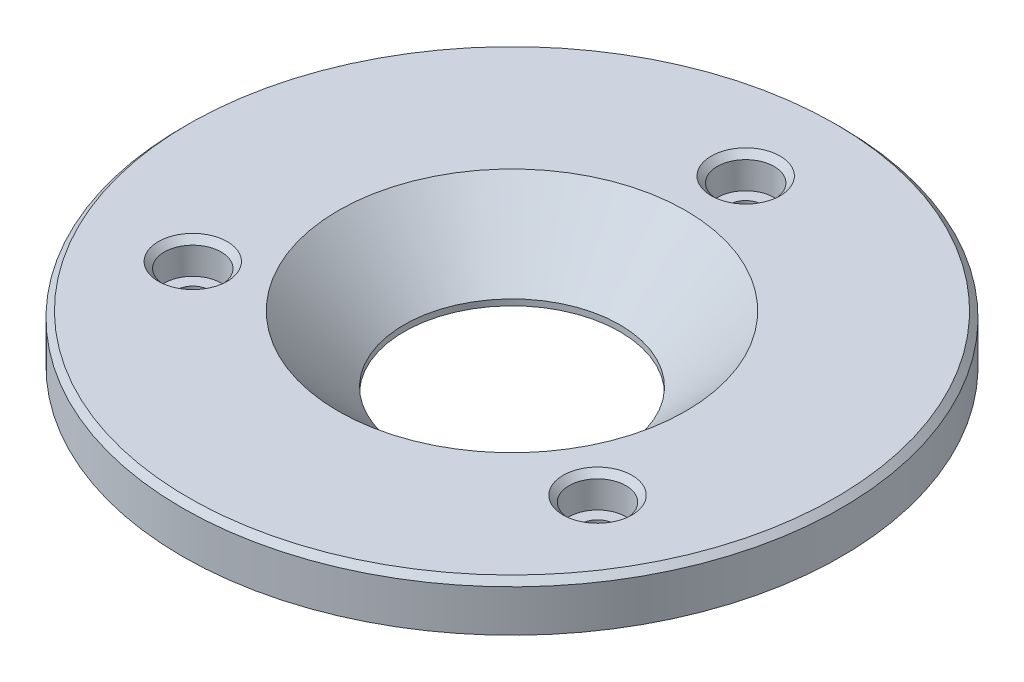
ISO-10303-21;
HEADER;
FILE_DESCRIPTION(('STEP AP214'),'2;1');
FILE_NAME('part.step','',(''),(''),'','','');
FILE_SCHEMA(('AUTOMOTIVE_DESIGN { 1 0 10303 214 1 1 1 1 }'));
ENDSEC;
DATA;
#1=APPLICATION_CONTEXT('core data for automotive mechanical design processes');
#2=APPLICATION_PROTOCOL_DEFINITION('international standard','automotive_design',2000,#1);
#3=PRODUCT_CONTEXT('',#1,'mechanical');
#4=PRODUCT('Part','Part','',(#3));
#5=PRODUCT_RELATED_PRODUCT_CATEGORY('part','',(#4));
#6=PRODUCT_DEFINITION_FORMATION('','',#4);
#7=PRODUCT_DEFINITION_CONTEXT('part definition',#1,'design');
#8=PRODUCT_DEFINITION('design','',#6,#7);
#9=PRODUCT_DEFINITION_SHAPE('','',#8);
#10=(LENGTH_UNIT() NAMED_UNIT(*) SI_UNIT(.MILLI.,.METRE.));
#11=(NAMED_UNIT(*) PLANE_ANGLE_UNIT() SI_UNIT($,.RADIAN.));
#12=(NAMED_UNIT(*) SI_UNIT($,.STERADIAN.) SOLID_ANGLE_UNIT());
#13=UNCERTAINTY_MEASURE_WITH_UNIT(LENGTH_MEASURE(1.E-05),#10,'distance_accuracy_value','');
#14=(GEOMETRIC_REPRESENTATION_CONTEXT(3) GLOBAL_UNCERTAINTY_ASSIGNED_CONTEXT((#13)) GLOBAL_UNIT_ASSIGNED_CONTEXT((#10,
#11,#12)) REPRESENTATION_CONTEXT('',''));
#15=CARTESIAN_POINT('',(0.,0.,0.));
#16=DIRECTION('',(0.,0.,1.));
#17=DIRECTION('',(1.,0.,0.));
#18=AXIS2_PLACEMENT_3D('',#15,#16,#17);
#19=CARTESIAN_POINT('',(-29.,12.,0.));
#20=DIRECTION('',(0.,-1.,0.));
#21=DIRECTION('',(0.,0.,-1.));
#22=AXIS2_PLACEMENT_3D('',#19,#20,#21);
#23=PLANE('',#22);
#24=CARTESIAN_POINT('',(33.7749907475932,12.,19.5));
#25=DIRECTION('',(0.,-1.,0.));
#26=DIRECTION('',(0.,0.,-1.));
#27=AXIS2_PLACEMENT_3D('',#24,#25,#26);
#28=CIRCLE('',#27,5.75);
#29=CARTESIAN_POINT('',(33.7749907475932,12.,13.75));
#30=VERTEX_POINT('',#29);
#31=EDGE_CURVE('E25',#30,#30,#28,.T.);
#32=ORIENTED_EDGE('',*,*,#31,.T.);
#33=EDGE_LOOP('',(#32));
#34=FACE_BOUND('',#33,.T.);
#35=CARTESIAN_POINT('',(0.,12.,-39.));
#36=DIRECTION('',(0.,-1.,0.));
#37=DIRECTION('',(0.,0.,-1.));
#38=AXIS2_PLACEMENT_3D('',#35,#36,#37);
#39=CIRCLE('',#38,5.75);
#40=CARTESIAN_POINT('',(0.,12.,-44.75));
#41=VERTEX_POINT('',#40);
#42=EDGE_CURVE('E29',#41,#41,#39,.T.);
#43=ORIENTED_EDGE('',*,*,#42,.T.);
#44=EDGE_LOOP('',(#43));
#45=FACE_BOUND('',#44,.T.);
#46=CARTESIAN_POINT('',(-33.7749907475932,12.,19.5));
#47=DIRECTION('',(0.,-1.,0.));
#48=DIRECTION('',(0.,0.,-1.));
#49=AXIS2_PLACEMENT_3D('',#46,#47,#48);
#50=CIRCLE('',#49,5.75);
#51=CARTESIAN_POINT('',(-33.7749907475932,12.,13.75));
#52=VERTEX_POINT('',#51);
#53=EDGE_CURVE('E34',#52,#52,#50,.T.);
#54=ORIENTED_EDGE('',*,*,#53,.T.);
#55=EDGE_LOOP('',(#54));
#56=FACE_BOUND('',#55,.T.);
#57=CARTESIAN_POINT('',(0.,12.,0.));
#58=DIRECTION('',(0.,-1.,0.));
#59=DIRECTION('',(0.,0.,-1.));
#60=AXIS2_PLACEMENT_3D('',#57,#58,#59);
#61=CIRCLE('',#60,54.);
#62=CARTESIAN_POINT('',(0.,12.,-54.));
#63=VERTEX_POINT('',#62);
#64=EDGE_CURVE('E58',#63,#63,#61,.F.);
#65=ORIENTED_EDGE('',*,*,#64,.T.);
#66=EDGE_LOOP('',(#65));
#67=FACE_BOUND('',#66,.T.);
#68=CARTESIAN_POINT('',(0.,12.,0.));
#69=DIRECTION('',(0.,-1.,0.));
#70=DIRECTION('',(0.,0.,-1.));
#71=AXIS2_PLACEMENT_3D('',#68,#69,#70);
#72=CIRCLE('',#71,29.);
#73=CARTESIAN_POINT('',(0.,12.,-29.));
#74=VERTEX_POINT('',#73);
#75=EDGE_CURVE('E70',#74,#74,#72,.T.);
#76=ORIENTED_EDGE('',*,*,#75,.T.);
#77=EDGE_LOOP('',(#76));
#78=FACE_BOUND('',#77,.T.);
#79=ADVANCED_FACE('F14',(#34,#45,#56,#67,#78),#23,.F.);
#80=CARTESIAN_POINT('',(0.,1.,0.));
#81=DIRECTION('',(0.,1.,0.));
#82=DIRECTION('',(0.,0.,1.));
#83=AXIS2_PLACEMENT_3D('',#80,#81,#82);
#84=CONICAL_SURFACE('',#83,18.,0.78539816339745);
#85=ORIENTED_EDGE('',*,*,#75,.F.);
#86=EDGE_LOOP('',(#85));
#87=FACE_BOUND('',#86,.T.);
#88=CARTESIAN_POINT('',(0.,1.,0.));
#89=DIRECTION('',(0.,-1.,0.));
#90=DIRECTION('',(0.,0.,-1.));
#91=AXIS2_PLACEMENT_3D('',#88,#89,#90);
#92=CIRCLE('',#91,18.);
#93=CARTESIAN_POINT('',(0.,1.,-18.));
#94=VERTEX_POINT('',#93);
#95=EDGE_CURVE('E83',#94,#94,#92,.T.);
#96=ORIENTED_EDGE('',*,*,#95,.T.);
#97=EDGE_LOOP('',(#96));
#98=FACE_BOUND('',#97,.T.);
#99=ADVANCED_FACE('F123',(#87,#98),#84,.F.);
#100=CARTESIAN_POINT('',(0.,0.,0.));
#101=DIRECTION('',(0.,-1.,0.));
#102=DIRECTION('',(0.,0.,-1.));
#103=AXIS2_PLACEMENT_3D('',#100,#101,#102);
#104=CYLINDRICAL_SURFACE('',#103,18.);
#105=ORIENTED_EDGE('',*,*,#95,.F.);
#106=EDGE_LOOP('',(#105));
#107=FACE_BOUND('',#106,.T.);
#108=CARTESIAN_POINT('',(0.,0.,0.));
#109=DIRECTION('',(0.,-1.,0.));
#110=DIRECTION('',(0.,0.,-1.));
#111=AXIS2_PLACEMENT_3D('',#108,#109,#110);
#112=CIRCLE('',#111,18.);
#113=CARTESIAN_POINT('',(0.,0.,-18.));
#114=VERTEX_POINT('',#113);
#115=EDGE_CURVE('E86',#114,#114,#112,.T.);
#116=ORIENTED_EDGE('',*,*,#115,.T.);
#117=EDGE_LOOP('',(#116));
#118=FACE_BOUND('',#117,.T.);
#119=ADVANCED_FACE('F130',(#107,#118),#104,.F.);
#120=CARTESIAN_POINT('',(-18.,0.,0.));
#121=DIRECTION('',(0.,1.,0.));
#122=DIRECTION('',(0.,0.,1.));
#123=AXIS2_PLACEMENT_3D('',#120,#121,#122);
#124=PLANE('',#123);
#125=CARTESIAN_POINT('',(-33.7749907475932,0.,19.5));
#126=DIRECTION('',(0.,1.,0.));
#127=DIRECTION('',(0.,0.,1.));
#128=AXIS2_PLACEMENT_3D('',#125,#126,#127);
#129=CIRCLE('',#128,3.75);
#130=CARTESIAN_POINT('',(-33.7749907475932,0.,23.25));
#131=VERTEX_POINT('',#130);
#132=EDGE_CURVE('E49',#131,#131,#129,.T.);
#133=ORIENTED_EDGE('',*,*,#132,.T.);
#134=EDGE_LOOP('',(#133));
#135=FACE_BOUND('',#134,.T.);
#136=CARTESIAN_POINT('',(33.7749907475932,0.,19.5));
#137=DIRECTION('',(0.,1.,0.));
#138=DIRECTION('',(0.,0.,1.));
#139=AXIS2_PLACEMENT_3D('',#136,#137,#138);
#140=CIRCLE('',#139,3.75);
#141=CARTESIAN_POINT('',(33.7749907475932,0.,23.25));
#142=VERTEX_POINT('',#141);
#143=EDGE_CURVE('E52',#142,#142,#140,.T.);
#144=ORIENTED_EDGE('',*,*,#143,.T.);
#145=EDGE_LOOP('',(#144));
#146=FACE_BOUND('',#145,.T.);
#147=CARTESIAN_POINT('',(0.,0.,-39.));
#148=DIRECTION('',(0.,1.,0.));
#149=DIRECTION('',(0.,0.,1.));
#150=AXIS2_PLACEMENT_3D('',#147,#148,#149);
#151=CIRCLE('',#150,3.75);
#152=CARTESIAN_POINT('',(0.,0.,-35.25));
#153=VERTEX_POINT('',#152);
#154=EDGE_CURVE('E55',#153,#153,#151,.T.);
#155=ORIENTED_EDGE('',*,*,#154,.T.);
#156=EDGE_LOOP('',(#155));
#157=FACE_BOUND('',#156,.T.);
#158=CARTESIAN_POINT('',(0.,0.,0.));
#159=DIRECTION('',(0.,1.,0.));
#160=DIRECTION('',(0.,0.,1.));
#161=AXIS2_PLACEMENT_3D('',#158,#159,#160);
#162=CIRCLE('',#161,44.);
#163=CARTESIAN_POINT('',(0.,0.,44.));
#164=VERTEX_POINT('',#163);
#165=EDGE_CURVE('E67',#164,#164,#162,.F.);
#166=ORIENTED_EDGE('',*,*,#165,.T.);
#167=EDGE_LOOP('',(#166));
#168=FACE_BOUND('',#167,.T.);
#169=ORIENTED_EDGE('',*,*,#115,.F.);
#170=EDGE_LOOP('',(#169));
#171=FACE_BOUND('',#170,.T.);
#172=ADVANCED_FACE('F181',(#135,#146,#157,#168,#171),#124,.F.);
#173=CARTESIAN_POINT('',(0.,0.,0.));
#174=DIRECTION('',(0.,-1.,0.));
#175=DIRECTION('',(0.,0.,-1.));
#176=AXIS2_PLACEMENT_3D('',#173,#174,#175);
#177=CYLINDRICAL_SURFACE('',#176,45.);
#178=CARTESIAN_POINT('',(0.,1.00000000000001,0.));
#179=DIRECTION('',(0.,1.,0.));
#180=DIRECTION('',(0.,0.,1.));
#181=AXIS2_PLACEMENT_3D('',#178,#179,#180);
#182=CIRCLE('',#181,45.);
#183=CARTESIAN_POINT('',(0.,1.00000000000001,45.));
#184=VERTEX_POINT('',#183);
#185=EDGE_CURVE('E64',#184,#184,#182,.T.);
#186=ORIENTED_EDGE('',*,*,#185,.T.);
#187=EDGE_LOOP('',(#186));
#188=FACE_BOUND('',#187,.T.);
#189=CARTESIAN_POINT('',(0.,4.,0.));
#190=DIRECTION('',(0.,-1.,0.));
#191=DIRECTION('',(0.,0.,-1.));
#192=AXIS2_PLACEMENT_3D('',#189,#190,#191);
#193=CIRCLE('',#192,45.);
#194=CARTESIAN_POINT('',(0.,4.,-45.));
#195=VERTEX_POINT('',#194);
#196=EDGE_CURVE('E89',#195,#195,#193,.T.);
#197=ORIENTED_EDGE('',*,*,#196,.T.);
#198=EDGE_LOOP('',(#197));
#199=FACE_BOUND('',#198,.T.);
#200=ADVANCED_FACE('F185',(#188,#199),#177,.T.);
#201=CARTESIAN_POINT('',(-45.,4.,0.));
#202=DIRECTION('',(0.,1.,0.));
#203=DIRECTION('',(0.,0.,1.));
#204=AXIS2_PLACEMENT_3D('',#201,#202,#203);
#205=PLANE('',#204);
#206=ORIENTED_EDGE('',*,*,#196,.F.);
#207=EDGE_LOOP('',(#206));
#208=FACE_BOUND('',#207,.T.);
#209=CARTESIAN_POINT('',(0.,4.,0.));
#210=DIRECTION('',(0.,-1.,0.));
#211=DIRECTION('',(0.,0.,-1.));
#212=AXIS2_PLACEMENT_3D('',#209,#210,#211);
#213=CIRCLE('',#212,55.);
#214=CARTESIAN_POINT('',(0.,4.,-55.));
#215=VERTEX_POINT('',#214);
#216=EDGE_CURVE('E92',#215,#215,#213,.T.);
#217=ORIENTED_EDGE('',*,*,#216,.T.);
#218=EDGE_LOOP('',(#217));
#219=FACE_BOUND('',#218,.T.);
#220=ADVANCED_FACE('F192',(#208,#219),#205,.F.);
#221=CARTESIAN_POINT('',(0.,0.,0.));
#222=DIRECTION('',(0.,-1.,0.));
#223=DIRECTION('',(0.,0.,-1.));
#224=AXIS2_PLACEMENT_3D('',#221,#222,#223);
#225=CYLINDRICAL_SURFACE('',#224,55.);
#226=CARTESIAN_POINT('',(0.,11.,0.));
#227=DIRECTION('',(0.,-1.,0.));
#228=DIRECTION('',(0.,0.,-1.));
#229=AXIS2_PLACEMENT_3D('',#226,#227,#228);
#230=CIRCLE('',#229,55.);
#231=CARTESIAN_POINT('',(0.,11.,-55.));
#232=VERTEX_POINT('',#231);
#233=EDGE_CURVE('E61',#232,#232,#230,.T.);
#234=ORIENTED_EDGE('',*,*,#233,.T.);
#235=EDGE_LOOP('',(#234));
#236=FACE_BOUND('',#235,.T.);
#237=ORIENTED_EDGE('',*,*,#216,.F.);
#238=EDGE_LOOP('',(#237));
#239=FACE_BOUND('',#238,.T.);
#240=ADVANCED_FACE('F199',(#236,#239),#225,.T.);
#241=CARTESIAN_POINT('',(33.7749907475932,6.5,19.5));
#242=DIRECTION('',(0.,1.,0.));
#243=DIRECTION('',(0.,0.,1.));
#244=AXIS2_PLACEMENT_3D('',#241,#242,#243);
#245=CYLINDRICAL_SURFACE('',#244,4.75);
#246=CARTESIAN_POINT('',(33.7749907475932,11.,19.5));
#247=DIRECTION('',(0.,-1.,0.));
#248=DIRECTION('',(0.,0.,-1.));
#249=AXIS2_PLACEMENT_3D('',#246,#247,#248);
#250=CIRCLE('',#249,4.75);
#251=CARTESIAN_POINT('',(33.7749907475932,11.,14.75));
#252=VERTEX_POINT('',#251);
#253=EDGE_CURVE('E37',#252,#252,#250,.F.);
#254=ORIENTED_EDGE('',*,*,#253,.T.);
#255=EDGE_LOOP('',(#254));
#256=FACE_BOUND('',#255,.T.);
#257=CARTESIAN_POINT('',(33.7749907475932,6.5,19.5));
#258=DIRECTION('',(0.,1.,0.));
#259=DIRECTION('',(0.,0.,-1.));
#260=AXIS2_PLACEMENT_3D('',#257,#258,#259);
#261=CIRCLE('',#260,4.75);
#262=CARTESIAN_POINT('',(33.7749907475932,6.5,14.75));
#263=VERTEX_POINT('',#262);
#264=EDGE_CURVE('E74',#263,#263,#261,.T.);
#265=ORIENTED_EDGE('',*,*,#264,.F.);
#266=EDGE_LOOP('',(#265));
#267=FACE_BOUND('',#266,.T.);
#268=ADVANCED_FACE('F203',(#256,#267),#245,.F.);
#269=CARTESIAN_POINT('',(33.7749907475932,6.5,19.5));
#270=DIRECTION('',(0.,-1.,0.));
#271=DIRECTION('',(0.,0.,-1.));
#272=AXIS2_PLACEMENT_3D('',#269,#270,#271);
#273=PLANE('',#272);
#274=CARTESIAN_POINT('',(33.7749907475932,6.5,19.5));
#275=DIRECTION('',(0.,-1.,0.));
#276=DIRECTION('',(0.,0.,-1.));
#277=AXIS2_PLACEMENT_3D('',#274,#275,#276);
#278=CIRCLE('',#277,2.75);
#279=CARTESIAN_POINT('',(33.7749907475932,6.5,16.75));
#280=VERTEX_POINT('',#279);
#281=EDGE_CURVE('E71',#280,#280,#278,.T.);
#282=ORIENTED_EDGE('',*,*,#281,.T.);
#283=EDGE_LOOP('',(#282));
#284=FACE_BOUND('',#283,.T.);
#285=ORIENTED_EDGE('',*,*,#264,.T.);
#286=EDGE_LOOP('',(#285));
#287=FACE_BOUND('',#286,.T.);
#288=ADVANCED_FACE('F207',(#284,#287),#273,.F.);
#289=CARTESIAN_POINT('',(-33.7749907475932,6.5,19.5));
#290=DIRECTION('',(0.,1.,0.));
#291=DIRECTION('',(0.,0.,1.));
#292=AXIS2_PLACEMENT_3D('',#289,#290,#291);
#293=CYLINDRICAL_SURFACE('',#292,4.75);
#294=CARTESIAN_POINT('',(-33.7749907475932,11.,19.5));
#295=DIRECTION('',(0.,-1.,0.));
#296=DIRECTION('',(0.,0.,-1.));
#297=AXIS2_PLACEMENT_3D('',#294,#295,#296);
#298=CIRCLE('',#297,4.75);
#299=CARTESIAN_POINT('',(-33.7749907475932,11.,14.75));
#300=VERTEX_POINT('',#299);
#301=EDGE_CURVE('E9',#300,#300,#298,.F.);
#302=ORIENTED_EDGE('',*,*,#301,.T.);
#303=EDGE_LOOP('',(#302));
#304=FACE_BOUND('',#303,.T.);
#305=CARTESIAN_POINT('',(-33.7749907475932,6.5,19.5));
#306=DIRECTION('',(0.,1.,0.));
#307=DIRECTION('',(0.,0.,1.));
#308=AXIS2_PLACEMENT_3D('',#305,#306,#307);
#309=CIRCLE('',#308,4.75);
#310=CARTESIAN_POINT('',(-33.7749907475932,6.5,24.25));
#311=VERTEX_POINT('',#310);
#312=EDGE_CURVE('E98',#311,#311,#309,.T.);
#313=ORIENTED_EDGE('',*,*,#312,.F.);
#314=EDGE_LOOP('',(#313));
#315=FACE_BOUND('',#314,.T.);
#316=ADVANCED_FACE('F119',(#304,#315),#293,.F.);
#317=CARTESIAN_POINT('',(-33.7749907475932,6.5,19.5));
#318=DIRECTION('',(0.,1.,0.));
#319=DIRECTION('',(0.,0.,1.));
#320=AXIS2_PLACEMENT_3D('',#317,#318,#319);
#321=PLANE('',#320);
#322=CARTESIAN_POINT('',(-33.7749907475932,6.5,19.5));
#323=DIRECTION('',(0.,1.,0.));
#324=DIRECTION('',(0.,0.,1.));
#325=AXIS2_PLACEMENT_3D('',#322,#323,#324);
#326=CIRCLE('',#325,2.75);
#327=CARTESIAN_POINT('',(-33.7749907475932,6.5,22.25));
#328=VERTEX_POINT('',#327);
#329=EDGE_CURVE('E75',#328,#328,#326,.T.);
#330=ORIENTED_EDGE('',*,*,#329,.F.);
#331=EDGE_LOOP('',(#330));
#332=FACE_BOUND('',#331,.T.);
#333=ORIENTED_EDGE('',*,*,#312,.T.);
#334=EDGE_LOOP('',(#333));
#335=FACE_BOUND('',#334,.T.);
#336=ADVANCED_FACE('F108',(#332,#335),#321,.T.);
#337=CARTESIAN_POINT('',(0.,6.5,-39.));
#338=DIRECTION('',(0.,1.,0.));
#339=DIRECTION('',(0.,0.,1.));
#340=AXIS2_PLACEMENT_3D('',#337,#338,#339);
#341=CYLINDRICAL_SURFACE('',#340,4.75);
#342=CARTESIAN_POINT('',(0.,11.,-39.));
#343=DIRECTION('',(0.,-1.,0.));
#344=DIRECTION('',(0.,0.,-1.));
#345=AXIS2_PLACEMENT_3D('',#342,#343,#344);
#346=CIRCLE('',#345,4.75);
#347=CARTESIAN_POINT('',(0.,11.,-43.75));
#348=VERTEX_POINT('',#347);
#349=EDGE_CURVE('E21',#348,#348,#346,.F.);
#350=ORIENTED_EDGE('',*,*,#349,.T.);
#351=EDGE_LOOP('',(#350));
#352=FACE_BOUND('',#351,.T.);
#353=CARTESIAN_POINT('',(0.,6.5,-39.));
#354=DIRECTION('',(0.,1.,0.));
#355=DIRECTION('',(0.,0.,1.));
#356=AXIS2_PLACEMENT_3D('',#353,#354,#355);
#357=CIRCLE('',#356,4.75);
#358=CARTESIAN_POINT('',(0.,6.5,-34.25));
#359=VERTEX_POINT('',#358);
#360=EDGE_CURVE('E95',#359,#359,#357,.T.);
#361=ORIENTED_EDGE('',*,*,#360,.F.);
#362=EDGE_LOOP('',(#361));
#363=FACE_BOUND('',#362,.T.);
#364=ADVANCED_FACE('F106',(#352,#363),#341,.F.);
#365=CARTESIAN_POINT('',(0.,6.5,-39.));
#366=DIRECTION('',(0.,1.,0.));
#367=DIRECTION('',(0.,0.,1.));
#368=AXIS2_PLACEMENT_3D('',#365,#366,#367);
#369=PLANE('',#368);
#370=CARTESIAN_POINT('',(0.,6.5,-39.));
#371=DIRECTION('',(0.,1.,0.));
#372=DIRECTION('',(0.,0.,1.));
#373=AXIS2_PLACEMENT_3D('',#370,#371,#372);
#374=CIRCLE('',#373,2.75);
#375=CARTESIAN_POINT('',(0.,6.5,-36.25));
#376=VERTEX_POINT('',#375);
#377=EDGE_CURVE('E78',#376,#376,#374,.T.);
#378=ORIENTED_EDGE('',*,*,#377,.F.);
#379=EDGE_LOOP('',(#378));
#380=FACE_BOUND('',#379,.T.);
#381=ORIENTED_EDGE('',*,*,#360,.T.);
#382=EDGE_LOOP('',(#381));
#383=FACE_BOUND('',#382,.T.);
#384=ADVANCED_FACE('F104',(#380,#383),#369,.T.);
#385=CARTESIAN_POINT('',(0.,0.,-39.));
#386=DIRECTION('',(0.,1.,0.));
#387=DIRECTION('',(0.,0.,1.));
#388=AXIS2_PLACEMENT_3D('',#385,#386,#387);
#389=CYLINDRICAL_SURFACE('',#388,2.75);
#390=CARTESIAN_POINT('',(0.,1.,-39.));
#391=DIRECTION('',(0.,1.,0.));
#392=DIRECTION('',(0.,0.,1.));
#393=AXIS2_PLACEMENT_3D('',#390,#391,#392);
#394=CIRCLE('',#393,2.75);
#395=CARTESIAN_POINT('',(0.,1.,-36.25));
#396=VERTEX_POINT('',#395);
#397=EDGE_CURVE('E40',#396,#396,#394,.F.);
#398=ORIENTED_EDGE('',*,*,#397,.T.);
#399=EDGE_LOOP('',(#398));
#400=FACE_BOUND('',#399,.T.);
#401=ORIENTED_EDGE('',*,*,#377,.T.);
#402=EDGE_LOOP('',(#401));
#403=FACE_BOUND('',#402,.T.);
#404=ADVANCED_FACE('F116',(#400,#403),#389,.F.);
#405=CARTESIAN_POINT('',(-33.7749907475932,0.,19.5));
#406=DIRECTION('',(0.,1.,0.));
#407=DIRECTION('',(0.,0.,1.));
#408=AXIS2_PLACEMENT_3D('',#405,#406,#407);
#409=CYLINDRICAL_SURFACE('',#408,2.75);
#410=CARTESIAN_POINT('',(-33.7749907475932,1.,19.5));
#411=DIRECTION('',(0.,1.,0.));
#412=DIRECTION('',(0.,0.,1.));
#413=AXIS2_PLACEMENT_3D('',#410,#411,#412);
#414=CIRCLE('',#413,2.75);
#415=CARTESIAN_POINT('',(-33.7749907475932,1.,22.25));
#416=VERTEX_POINT('',#415);
#417=EDGE_CURVE('E46',#416,#416,#414,.F.);
#418=ORIENTED_EDGE('',*,*,#417,.T.);
#419=EDGE_LOOP('',(#418));
#420=FACE_BOUND('',#419,.T.);
#421=ORIENTED_EDGE('',*,*,#329,.T.);
#422=EDGE_LOOP('',(#421));
#423=FACE_BOUND('',#422,.T.);
#424=ADVANCED_FACE('F338',(#420,#423),#409,.F.);
#425=CARTESIAN_POINT('',(33.7749907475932,0.,19.5));
#426=DIRECTION('',(0.,1.,0.));
#427=DIRECTION('',(0.,0.,1.));
#428=AXIS2_PLACEMENT_3D('',#425,#426,#427);
#429=CYLINDRICAL_SURFACE('',#428,2.75);
#430=CARTESIAN_POINT('',(33.7749907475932,1.,19.5));
#431=DIRECTION('',(0.,1.,0.));
#432=DIRECTION('',(0.,0.,1.));
#433=AXIS2_PLACEMENT_3D('',#430,#431,#432);
#434=CIRCLE('',#433,2.75);
#435=CARTESIAN_POINT('',(33.7749907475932,1.,22.25));
#436=VERTEX_POINT('',#435);
#437=EDGE_CURVE('E43',#436,#436,#434,.F.);
#438=ORIENTED_EDGE('',*,*,#437,.T.);
#439=EDGE_LOOP('',(#438));
#440=FACE_BOUND('',#439,.T.);
#441=ORIENTED_EDGE('',*,*,#281,.F.);
#442=EDGE_LOOP('',(#441));
#443=FACE_BOUND('',#442,.T.);
#444=ADVANCED_FACE('F140',(#440,#443),#429,.F.);
#445=CARTESIAN_POINT('',(0.,0.,0.));
#446=DIRECTION('',(0.,1.,0.));
#447=DIRECTION('',(0.,0.,1.));
#448=AXIS2_PLACEMENT_3D('',#445,#446,#447);
#449=CONICAL_SURFACE('',#448,44.,0.785398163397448);
#450=ORIENTED_EDGE('',*,*,#185,.F.);
#451=EDGE_LOOP('',(#450));
#452=FACE_BOUND('',#451,.T.);
#453=ORIENTED_EDGE('',*,*,#165,.F.);
#454=EDGE_LOOP('',(#453));
#455=FACE_BOUND('',#454,.T.);
#456=ADVANCED_FACE('F136',(#452,#455),#449,.T.);
#457=CARTESIAN_POINT('',(0.,11.,0.));
#458=DIRECTION('',(0.,-1.,0.));
#459=DIRECTION('',(0.,0.,-1.));
#460=AXIS2_PLACEMENT_3D('',#457,#458,#459);
#461=CONICAL_SURFACE('',#460,55.,0.785398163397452);
#462=ORIENTED_EDGE('',*,*,#64,.F.);
#463=EDGE_LOOP('',(#462));
#464=FACE_BOUND('',#463,.T.);
#465=ORIENTED_EDGE('',*,*,#233,.F.);
#466=EDGE_LOOP('',(#465));
#467=FACE_BOUND('',#466,.T.);
#468=ADVANCED_FACE('F139',(#464,#467),#461,.T.);
#469=CARTESIAN_POINT('',(-33.7749907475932,0.,19.5));
#470=DIRECTION('',(0.,-1.,0.));
#471=DIRECTION('',(0.,0.,-1.));
#472=AXIS2_PLACEMENT_3D('',#469,#470,#471);
#473=CONICAL_SURFACE('',#472,3.75,0.785398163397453);
#474=ORIENTED_EDGE('',*,*,#417,.F.);
#475=EDGE_LOOP('',(#474));
#476=FACE_BOUND('',#475,.T.);
#477=ORIENTED_EDGE('',*,*,#132,.F.);
#478=EDGE_LOOP('',(#477));
#479=FACE_BOUND('',#478,.T.);
#480=ADVANCED_FACE('F144',(#476,#479),#473,.F.);
#481=CARTESIAN_POINT('',(33.7749907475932,0.,19.5));
#482=DIRECTION('',(0.,-1.,0.));
#483=DIRECTION('',(0.,0.,-1.));
#484=AXIS2_PLACEMENT_3D('',#481,#482,#483);
#485=CONICAL_SURFACE('',#484,3.75,0.785398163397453);
#486=ORIENTED_EDGE('',*,*,#437,.F.);
#487=EDGE_LOOP('',(#486));
#488=FACE_BOUND('',#487,.T.);
#489=ORIENTED_EDGE('',*,*,#143,.F.);
#490=EDGE_LOOP('',(#489));
#491=FACE_BOUND('',#490,.T.);
#492=ADVANCED_FACE('F148',(#488,#491),#485,.F.);
#493=CARTESIAN_POINT('',(0.,0.,-39.));
#494=DIRECTION('',(0.,-1.,0.));
#495=DIRECTION('',(0.,0.,-1.));
#496=AXIS2_PLACEMENT_3D('',#493,#494,#495);
#497=CONICAL_SURFACE('',#496,3.75,0.785398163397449);
#498=ORIENTED_EDGE('',*,*,#397,.F.);
#499=EDGE_LOOP('',(#498));
#500=FACE_BOUND('',#499,.T.);
#501=ORIENTED_EDGE('',*,*,#154,.F.);
#502=EDGE_LOOP('',(#501));
#503=FACE_BOUND('',#502,.T.);
#504=ADVANCED_FACE('F152',(#500,#503),#497,.F.);
#505=CARTESIAN_POINT('',(33.7749907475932,11.,19.5));
#506=DIRECTION('',(0.,1.,0.));
#507=DIRECTION('',(0.,0.,1.));
#508=AXIS2_PLACEMENT_3D('',#505,#506,#507);
#509=CONICAL_SURFACE('',#508,4.75,0.785398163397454);
#510=ORIENTED_EDGE('',*,*,#31,.F.);
#511=EDGE_LOOP('',(#510));
#512=FACE_BOUND('',#511,.T.);
#513=ORIENTED_EDGE('',*,*,#253,.F.);
#514=EDGE_LOOP('',(#513));
#515=FACE_BOUND('',#514,.T.);
#516=ADVANCED_FACE('F156',(#512,#515),#509,.F.);
#517=CARTESIAN_POINT('',(0.,11.,-39.));
#518=DIRECTION('',(0.,1.,0.));
#519=DIRECTION('',(0.,0.,1.));
#520=AXIS2_PLACEMENT_3D('',#517,#518,#519);
#521=CONICAL_SURFACE('',#520,4.75,0.785398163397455);
#522=ORIENTED_EDGE('',*,*,#42,.F.);
#523=EDGE_LOOP('',(#522));
#524=FACE_BOUND('',#523,.T.);
#525=ORIENTED_EDGE('',*,*,#349,.F.);
#526=EDGE_LOOP('',(#525));
#527=FACE_BOUND('',#526,.T.);
#528=ADVANCED_FACE('F159',(#524,#527),#521,.F.);
#529=CARTESIAN_POINT('',(-33.7749907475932,11.,19.5));
#530=DIRECTION('',(0.,1.,0.));
#531=DIRECTION('',(0.,0.,1.));
#532=AXIS2_PLACEMENT_3D('',#529,#530,#531);
#533=CONICAL_SURFACE('',#532,4.75,0.785398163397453);
#534=ORIENTED_EDGE('',*,*,#53,.F.);
#535=EDGE_LOOP('',(#534));
#536=FACE_BOUND('',#535,.T.);
#537=ORIENTED_EDGE('',*,*,#301,.F.);
#538=EDGE_LOOP('',(#537));
#539=FACE_BOUND('',#538,.T.);
#540=ADVANCED_FACE('F16',(#536,#539),#533,.F.);
#541=CLOSED_SHELL('',(#79,#99,#119,#172,#200,#220,#240,#268,#288,#316,#336,#364,#384,#404,#424,
#444,#456,#468,#480,#492,#504,#516,#528,#540));
#542=MANIFOLD_SOLID_BREP('B1',#541);
#543=ADVANCED_BREP_SHAPE_REPRESENTATION('',(#18,#542),#14);
#544=SHAPE_DEFINITION_REPRESENTATION(#9,#543);
ENDSEC;
END-ISO-10303-21;
